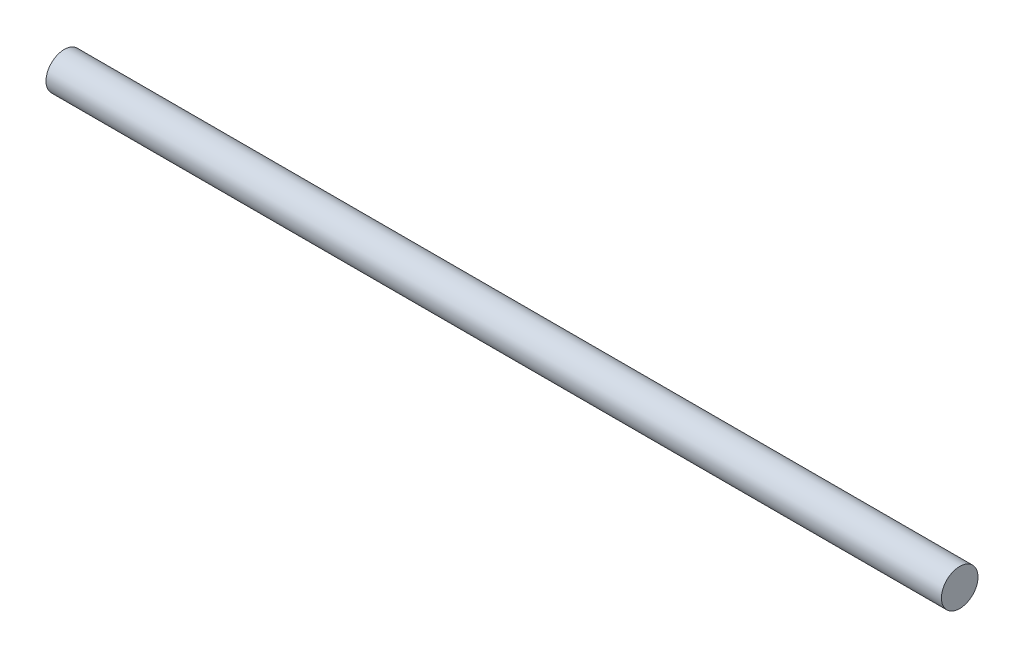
ISO-10303-21;
HEADER;
FILE_DESCRIPTION(('STEP AP214'),'2;1');
FILE_NAME('part.step','',(''),(''),'','','');
FILE_SCHEMA(('AUTOMOTIVE_DESIGN { 1 0 10303 214 1 1 1 1 }'));
ENDSEC;
DATA;
#1=APPLICATION_CONTEXT('core data for automotive mechanical design processes');
#2=APPLICATION_PROTOCOL_DEFINITION('international standard','automotive_design',2000,#1);
#3=PRODUCT_CONTEXT('',#1,'mechanical');
#4=PRODUCT('Part','Part','',(#3));
#5=PRODUCT_RELATED_PRODUCT_CATEGORY('part','',(#4));
#6=PRODUCT_DEFINITION_FORMATION('','',#4);
#7=PRODUCT_DEFINITION_CONTEXT('part definition',#1,'design');
#8=PRODUCT_DEFINITION('design','',#6,#7);
#9=PRODUCT_DEFINITION_SHAPE('','',#8);
#10=(LENGTH_UNIT() NAMED_UNIT(*) SI_UNIT(.MILLI.,.METRE.));
#11=(NAMED_UNIT(*) PLANE_ANGLE_UNIT() SI_UNIT($,.RADIAN.));
#12=(NAMED_UNIT(*) SI_UNIT($,.STERADIAN.) SOLID_ANGLE_UNIT());
#13=UNCERTAINTY_MEASURE_WITH_UNIT(LENGTH_MEASURE(1.E-05),#10,'distance_accuracy_value','');
#14=(GEOMETRIC_REPRESENTATION_CONTEXT(3) GLOBAL_UNCERTAINTY_ASSIGNED_CONTEXT((#13)) GLOBAL_UNIT_ASSIGNED_CONTEXT((#10,
#11,#12)) REPRESENTATION_CONTEXT('',''));
#15=CARTESIAN_POINT('',(0.,0.,0.));
#16=DIRECTION('',(0.,0.,1.));
#17=DIRECTION('',(1.,0.,0.));
#18=AXIS2_PLACEMENT_3D('',#15,#16,#17);
#19=CARTESIAN_POINT('',(23.0447574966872,-139.,0.));
#20=DIRECTION('',(-1.,0.,0.));
#21=DIRECTION('',(0.,-1.,0.));
#22=AXIS2_PLACEMENT_3D('',#19,#20,#21);
#23=PLANE('',#22);
#24=CARTESIAN_POINT('',(23.0447574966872,-139.,0.));
#25=DIRECTION('',(1.,0.,0.));
#26=DIRECTION('',(0.,1.,0.));
#27=AXIS2_PLACEMENT_3D('',#24,#25,#26);
#28=CIRCLE('',#27,1.99999999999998);
#29=CARTESIAN_POINT('',(23.0447574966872,-137.,0.));
#30=VERTEX_POINT('',#29);
#31=EDGE_CURVE('E10',#30,#30,#28,.T.);
#32=ORIENTED_EDGE('',*,*,#31,.F.);
#33=EDGE_LOOP('',(#32));
#34=FACE_BOUND('',#33,.T.);
#35=ADVANCED_FACE('F352',(#34),#23,.T.);
#36=CARTESIAN_POINT('',(229.730472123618,-139.,0.));
#37=DIRECTION('',(1.,0.,0.));
#38=DIRECTION('',(0.,1.,0.));
#39=AXIS2_PLACEMENT_3D('',#36,#37,#38);
#40=CYLINDRICAL_SURFACE('',#39,1.99999999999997);
#41=ORIENTED_EDGE('',*,*,#31,.T.);
#42=EDGE_LOOP('',(#41));
#43=FACE_BOUND('',#42,.T.);
#44=CARTESIAN_POINT('',(120.91769514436,-139.,0.));
#45=DIRECTION('',(1.,0.,0.));
#46=DIRECTION('',(0.,1.,0.));
#47=AXIS2_PLACEMENT_3D('',#44,#45,#46);
#48=CIRCLE('',#47,1.99999999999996);
#49=CARTESIAN_POINT('',(120.91769514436,-137.,0.));
#50=VERTEX_POINT('',#49);
#51=EDGE_CURVE('E358',#50,#50,#48,.T.);
#52=ORIENTED_EDGE('',*,*,#51,.F.);
#53=EDGE_LOOP('',(#52));
#54=FACE_BOUND('',#53,.T.);
#55=ADVANCED_FACE('F366',(#43,#54),#40,.T.);
#56=CARTESIAN_POINT('',(120.91769514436,-137.,0.));
#57=DIRECTION('',(1.,0.,0.));
#58=DIRECTION('',(0.,1.,0.));
#59=AXIS2_PLACEMENT_3D('',#56,#57,#58);
#60=PLANE('',#59);
#61=ORIENTED_EDGE('',*,*,#51,.T.);
#62=EDGE_LOOP('',(#61));
#63=FACE_BOUND('',#62,.T.);
#64=ADVANCED_FACE('F364',(#63),#60,.T.);
#65=CLOSED_SHELL('',(#35,#55,#64));
#66=MANIFOLD_SOLID_BREP('B2',#65);
#67=ADVANCED_BREP_SHAPE_REPRESENTATION('',(#18,#66),#14);
#68=SHAPE_DEFINITION_REPRESENTATION(#9,#67);
ENDSEC;
END-ISO-10303-21;
